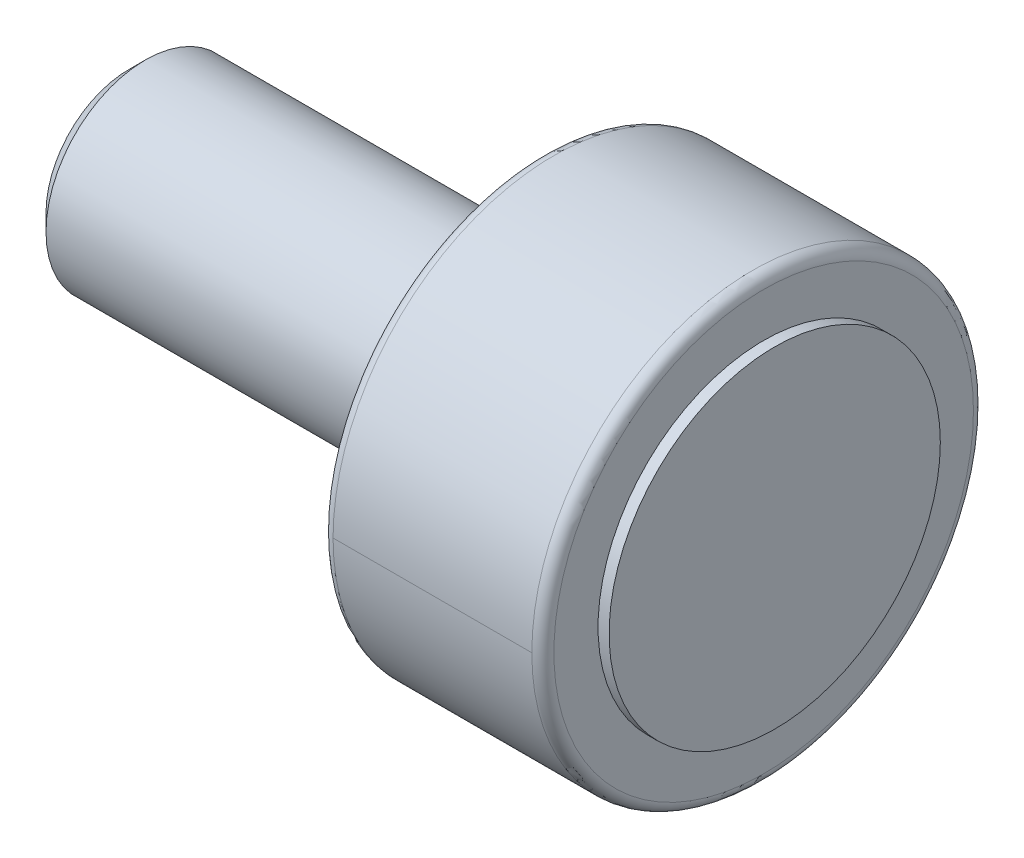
ISO-10303-21;
HEADER;
FILE_DESCRIPTION(('STEP AP214'),'2;1');
FILE_NAME('part.step','',(''),(''),'','','');
FILE_SCHEMA(('AUTOMOTIVE_DESIGN { 1 0 10303 214 1 1 1 1 }'));
ENDSEC;
DATA;
#1=APPLICATION_CONTEXT('core data for automotive mechanical design processes');
#2=APPLICATION_PROTOCOL_DEFINITION('international standard','automotive_design',2000,#1);
#3=PRODUCT_CONTEXT('',#1,'mechanical');
#4=PRODUCT('Part','Part','',(#3));
#5=PRODUCT_RELATED_PRODUCT_CATEGORY('part','',(#4));
#6=PRODUCT_DEFINITION_FORMATION('','',#4);
#7=PRODUCT_DEFINITION_CONTEXT('part definition',#1,'design');
#8=PRODUCT_DEFINITION('design','',#6,#7);
#9=PRODUCT_DEFINITION_SHAPE('','',#8);
#10=(LENGTH_UNIT() NAMED_UNIT(*) SI_UNIT(.MILLI.,.METRE.));
#11=(NAMED_UNIT(*) PLANE_ANGLE_UNIT() SI_UNIT($,.RADIAN.));
#12=(NAMED_UNIT(*) SI_UNIT($,.STERADIAN.) SOLID_ANGLE_UNIT());
#13=UNCERTAINTY_MEASURE_WITH_UNIT(LENGTH_MEASURE(1.E-05),#10,'distance_accuracy_value','');
#14=(GEOMETRIC_REPRESENTATION_CONTEXT(3) GLOBAL_UNCERTAINTY_ASSIGNED_CONTEXT((#13)) GLOBAL_UNIT_ASSIGNED_CONTEXT((#10,
#11,#12)) REPRESENTATION_CONTEXT('',''));
#15=CARTESIAN_POINT('',(0.,0.,0.));
#16=DIRECTION('',(0.,0.,1.));
#17=DIRECTION('',(1.,0.,0.));
#18=AXIS2_PLACEMENT_3D('',#15,#16,#17);
#19=CARTESIAN_POINT('',(0.,0.,0.));
#20=DIRECTION('',(1.,0.,0.));
#21=DIRECTION('',(0.,0.,-1.));
#22=AXIS2_PLACEMENT_3D('',#19,#20,#21);
#23=CYLINDRICAL_SURFACE('',#22,20.);
#24=CARTESIAN_POINT('',(-2.,0.,0.));
#25=DIRECTION('',(1.,0.,0.));
#26=DIRECTION('',(0.,0.,-1.));
#27=AXIS2_PLACEMENT_3D('',#24,#25,#26);
#28=CIRCLE('',#27,20.);
#29=CARTESIAN_POINT('',(-2.,0.,20.));
#30=VERTEX_POINT('',#29);
#31=CARTESIAN_POINT('',(-2.,0.,-20.));
#32=VERTEX_POINT('',#31);
#33=EDGE_CURVE('E61',#30,#32,#28,.F.);
#34=ORIENTED_EDGE('',*,*,#33,.T.);
#35=DIRECTION('',(1.,0.,0.));
#36=VECTOR('',#35,1.);
#37=CARTESIAN_POINT('',(0.,0.,-20.));
#38=LINE('',#37,#36);
#39=CARTESIAN_POINT('',(-20.,0.,-20.));
#40=VERTEX_POINT('',#39);
#41=EDGE_CURVE('E11',#32,#40,#38,.F.);
#42=ORIENTED_EDGE('',*,*,#41,.T.);
#43=CARTESIAN_POINT('',(-20.,0.,0.));
#44=DIRECTION('',(-1.,0.,0.));
#45=DIRECTION('',(0.,0.,1.));
#46=AXIS2_PLACEMENT_3D('',#43,#44,#45);
#47=CIRCLE('',#46,20.);
#48=CARTESIAN_POINT('',(-20.,0.,20.));
#49=VERTEX_POINT('',#48);
#50=EDGE_CURVE('E117',#40,#49,#47,.F.);
#51=ORIENTED_EDGE('',*,*,#50,.T.);
#52=DIRECTION('',(1.,0.,0.));
#53=VECTOR('',#52,1.);
#54=CARTESIAN_POINT('',(0.,0.,20.));
#55=LINE('',#54,#53);
#56=EDGE_CURVE('E34',#49,#30,#55,.T.);
#57=ORIENTED_EDGE('',*,*,#56,.T.);
#58=EDGE_LOOP('',(#34,#42,#51,#57));
#59=FACE_BOUND('',#58,.T.);
#60=ADVANCED_FACE('F30',(#59),#23,.T.);
#61=CARTESIAN_POINT('',(0.,15.,0.));
#62=DIRECTION('',(1.,0.,0.));
#63=DIRECTION('',(0.,0.,-1.));
#64=AXIS2_PLACEMENT_3D('',#61,#62,#63);
#65=PLANE('',#64);
#66=CARTESIAN_POINT('',(0.,0.,0.));
#67=DIRECTION('',(1.,0.,0.));
#68=DIRECTION('',(0.,0.,-1.));
#69=AXIS2_PLACEMENT_3D('',#66,#67,#68);
#70=CIRCLE('',#69,15.);
#71=CARTESIAN_POINT('',(0.,0.,-15.));
#72=VERTEX_POINT('',#71);
#73=EDGE_CURVE('E113',#72,#72,#70,.T.);
#74=ORIENTED_EDGE('',*,*,#73,.T.);
#75=EDGE_LOOP('',(#74));
#76=FACE_BOUND('',#75,.T.);
#77=ADVANCED_FACE('F32',(#76),#65,.T.);
#78=CARTESIAN_POINT('',(0.,0.,0.));
#79=DIRECTION('',(1.,0.,0.));
#80=DIRECTION('',(0.,0.,-1.));
#81=AXIS2_PLACEMENT_3D('',#78,#79,#80);
#82=CYLINDRICAL_SURFACE('',#81,15.);
#83=CARTESIAN_POINT('',(-0.999999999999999,0.,0.));
#84=DIRECTION('',(1.,0.,0.));
#85=DIRECTION('',(0.,0.,-1.));
#86=AXIS2_PLACEMENT_3D('',#83,#84,#85);
#87=CIRCLE('',#86,15.);
#88=CARTESIAN_POINT('',(-0.999999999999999,0.,-15.));
#89=VERTEX_POINT('',#88);
#90=EDGE_CURVE('E110',#89,#89,#87,.T.);
#91=ORIENTED_EDGE('',*,*,#90,.T.);
#92=EDGE_LOOP('',(#91));
#93=FACE_BOUND('',#92,.T.);
#94=ORIENTED_EDGE('',*,*,#73,.F.);
#95=EDGE_LOOP('',(#94));
#96=FACE_BOUND('',#95,.T.);
#97=ADVANCED_FACE('F135',(#93,#96),#82,.T.);
#98=CARTESIAN_POINT('',(-0.999999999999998,20.,0.));
#99=DIRECTION('',(1.,0.,0.));
#100=DIRECTION('',(0.,0.,-1.));
#101=AXIS2_PLACEMENT_3D('',#98,#99,#100);
#102=PLANE('',#101);
#103=CARTESIAN_POINT('',(-0.999999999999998,0.,0.));
#104=DIRECTION('',(1.,0.,0.));
#105=DIRECTION('',(0.,0.,-1.));
#106=AXIS2_PLACEMENT_3D('',#103,#104,#105);
#107=CIRCLE('',#106,19.);
#108=CARTESIAN_POINT('',(-0.999999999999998,0.,-19.));
#109=VERTEX_POINT('',#108);
#110=EDGE_CURVE('E115',#109,#109,#107,.T.);
#111=ORIENTED_EDGE('',*,*,#110,.T.);
#112=EDGE_LOOP('',(#111));
#113=FACE_BOUND('',#112,.T.);
#114=ORIENTED_EDGE('',*,*,#90,.F.);
#115=EDGE_LOOP('',(#114));
#116=FACE_BOUND('',#115,.T.);
#117=ADVANCED_FACE('F141',(#113,#116),#102,.T.);
#118=ORIENTED_EDGE('',*,*,#41,.F.);
#119=EDGE_CURVE('E57',#32,#30,#28,.F.);
#120=ORIENTED_EDGE('',*,*,#119,.T.);
#121=ORIENTED_EDGE('',*,*,#56,.F.);
#122=EDGE_CURVE('E59',#49,#40,#47,.F.);
#123=ORIENTED_EDGE('',*,*,#122,.T.);
#124=EDGE_LOOP('',(#118,#120,#121,#123));
#125=FACE_BOUND('',#124,.T.);
#126=ADVANCED_FACE('F55',(#125),#23,.T.);
#127=CARTESIAN_POINT('',(-21.,15.,0.));
#128=DIRECTION('',(-1.,0.,0.));
#129=DIRECTION('',(0.,0.,1.));
#130=AXIS2_PLACEMENT_3D('',#127,#128,#129);
#131=PLANE('',#130);
#132=CARTESIAN_POINT('',(-21.,0.,0.));
#133=DIRECTION('',(-1.,0.,0.));
#134=DIRECTION('',(0.,0.,1.));
#135=AXIS2_PLACEMENT_3D('',#132,#133,#134);
#136=CIRCLE('',#135,19.);
#137=CARTESIAN_POINT('',(-21.,0.,19.));
#138=VERTEX_POINT('',#137);
#139=EDGE_CURVE('E66',#138,#138,#136,.T.);
#140=ORIENTED_EDGE('',*,*,#139,.T.);
#141=EDGE_LOOP('',(#140));
#142=FACE_BOUND('',#141,.T.);
#143=CARTESIAN_POINT('',(-21.,0.,0.));
#144=DIRECTION('',(1.,0.,0.));
#145=DIRECTION('',(0.,0.,-1.));
#146=AXIS2_PLACEMENT_3D('',#143,#144,#145);
#147=CIRCLE('',#146,15.);
#148=CARTESIAN_POINT('',(-21.,0.,-15.));
#149=VERTEX_POINT('',#148);
#150=EDGE_CURVE('E105',#149,#149,#147,.T.);
#151=ORIENTED_EDGE('',*,*,#150,.T.);
#152=EDGE_LOOP('',(#151));
#153=FACE_BOUND('',#152,.T.);
#154=ADVANCED_FACE('F140',(#142,#153),#131,.T.);
#155=CARTESIAN_POINT('',(0.,0.,0.));
#156=DIRECTION('',(1.,0.,0.));
#157=DIRECTION('',(0.,0.,-1.));
#158=AXIS2_PLACEMENT_3D('',#155,#156,#157);
#159=CYLINDRICAL_SURFACE('',#158,15.);
#160=CARTESIAN_POINT('',(-22.,0.,0.));
#161=DIRECTION('',(1.,0.,0.));
#162=DIRECTION('',(0.,0.,-1.));
#163=AXIS2_PLACEMENT_3D('',#160,#161,#162);
#164=CIRCLE('',#163,15.);
#165=CARTESIAN_POINT('',(-22.,0.,-15.));
#166=VERTEX_POINT('',#165);
#167=EDGE_CURVE('E102',#166,#166,#164,.T.);
#168=ORIENTED_EDGE('',*,*,#167,.T.);
#169=EDGE_LOOP('',(#168));
#170=FACE_BOUND('',#169,.T.);
#171=ORIENTED_EDGE('',*,*,#150,.F.);
#172=EDGE_LOOP('',(#171));
#173=FACE_BOUND('',#172,.T.);
#174=ADVANCED_FACE('F144',(#170,#173),#159,.T.);
#175=CARTESIAN_POINT('',(-22.,8.99999999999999,0.));
#176=DIRECTION('',(-1.,0.,0.));
#177=DIRECTION('',(0.,0.,1.));
#178=AXIS2_PLACEMENT_3D('',#175,#176,#177);
#179=PLANE('',#178);
#180=CARTESIAN_POINT('',(-22.,0.,0.));
#181=DIRECTION('',(1.,0.,0.));
#182=DIRECTION('',(0.,0.,-1.));
#183=AXIS2_PLACEMENT_3D('',#180,#181,#182);
#184=CIRCLE('',#183,8.99999999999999);
#185=CARTESIAN_POINT('',(-22.,0.,-8.99999999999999));
#186=VERTEX_POINT('',#185);
#187=EDGE_CURVE('E100',#186,#186,#184,.T.);
#188=ORIENTED_EDGE('',*,*,#187,.T.);
#189=EDGE_LOOP('',(#188));
#190=FACE_BOUND('',#189,.T.);
#191=ORIENTED_EDGE('',*,*,#167,.F.);
#192=EDGE_LOOP('',(#191));
#193=FACE_BOUND('',#192,.T.);
#194=ADVANCED_FACE('F96',(#190,#193),#179,.T.);
#195=CARTESIAN_POINT('',(0.,0.,0.));
#196=DIRECTION('',(1.,0.,0.));
#197=DIRECTION('',(0.,0.,-1.));
#198=AXIS2_PLACEMENT_3D('',#195,#196,#197);
#199=CYLINDRICAL_SURFACE('',#198,8.99999999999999);
#200=CARTESIAN_POINT('',(-57.,0.,0.));
#201=DIRECTION('',(-1.,0.,0.));
#202=DIRECTION('',(0.,0.,1.));
#203=AXIS2_PLACEMENT_3D('',#200,#201,#202);
#204=CIRCLE('',#203,8.99999999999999);
#205=CARTESIAN_POINT('',(-57.,0.,8.99999999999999));
#206=VERTEX_POINT('',#205);
#207=EDGE_CURVE('E68',#206,#206,#204,.F.);
#208=ORIENTED_EDGE('',*,*,#207,.T.);
#209=EDGE_LOOP('',(#208));
#210=FACE_BOUND('',#209,.T.);
#211=ORIENTED_EDGE('',*,*,#187,.F.);
#212=EDGE_LOOP('',(#211));
#213=FACE_BOUND('',#212,.T.);
#214=ADVANCED_FACE('F93',(#210,#213),#199,.T.);
#215=CARTESIAN_POINT('',(-58.5,0.,0.));
#216=DIRECTION('',(-1.,0.,0.));
#217=DIRECTION('',(0.,0.,1.));
#218=AXIS2_PLACEMENT_3D('',#215,#216,#217);
#219=PLANE('',#218);
#220=CARTESIAN_POINT('',(-58.5,0.,0.));
#221=DIRECTION('',(-1.,0.,0.));
#222=DIRECTION('',(0.,0.,1.));
#223=AXIS2_PLACEMENT_3D('',#220,#221,#222);
#224=CIRCLE('',#223,7.49999999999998);
#225=CARTESIAN_POINT('',(-58.5,0.,7.49999999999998));
#226=VERTEX_POINT('',#225);
#227=EDGE_CURVE('E75',#226,#226,#224,.T.);
#228=ORIENTED_EDGE('',*,*,#227,.T.);
#229=EDGE_LOOP('',(#228));
#230=FACE_BOUND('',#229,.T.);
#231=ADVANCED_FACE('F84',(#230),#219,.T.);
#232=CARTESIAN_POINT('',(-2.,0.,0.));
#233=DIRECTION('',(1.,0.,0.));
#234=DIRECTION('',(0.,0.,-1.));
#235=AXIS2_PLACEMENT_3D('',#232,#233,#234);
#236=TOROIDAL_SURFACE('',#235,19.,1.);
#237=ORIENTED_EDGE('',*,*,#119,.F.);
#238=ORIENTED_EDGE('',*,*,#33,.F.);
#239=EDGE_LOOP('',(#237,#238));
#240=FACE_BOUND('',#239,.T.);
#241=ORIENTED_EDGE('',*,*,#110,.F.);
#242=EDGE_LOOP('',(#241));
#243=FACE_BOUND('',#242,.T.);
#244=ADVANCED_FACE('F64',(#240,#243),#236,.T.);
#245=CARTESIAN_POINT('',(-20.,0.,0.));
#246=DIRECTION('',(-1.,0.,0.));
#247=DIRECTION('',(0.,0.,1.));
#248=AXIS2_PLACEMENT_3D('',#245,#246,#247);
#249=TOROIDAL_SURFACE('',#248,19.,1.);
#250=ORIENTED_EDGE('',*,*,#139,.F.);
#251=EDGE_LOOP('',(#250));
#252=FACE_BOUND('',#251,.T.);
#253=ORIENTED_EDGE('',*,*,#122,.F.);
#254=ORIENTED_EDGE('',*,*,#50,.F.);
#255=EDGE_LOOP('',(#253,#254));
#256=FACE_BOUND('',#255,.T.);
#257=ADVANCED_FACE('F89',(#252,#256),#249,.T.);
#258=CARTESIAN_POINT('',(-57.,0.,0.));
#259=DIRECTION('',(1.,0.,0.));
#260=DIRECTION('',(0.,0.,-1.));
#261=AXIS2_PLACEMENT_3D('',#258,#259,#260);
#262=CONICAL_SURFACE('',#261,8.99999999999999,0.785398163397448);
#263=ORIENTED_EDGE('',*,*,#227,.F.);
#264=EDGE_LOOP('',(#263));
#265=FACE_BOUND('',#264,.T.);
#266=ORIENTED_EDGE('',*,*,#207,.F.);
#267=EDGE_LOOP('',(#266));
#268=FACE_BOUND('',#267,.T.);
#269=ADVANCED_FACE('F86',(#265,#268),#262,.T.);
#270=CLOSED_SHELL('',(#60,#77,#97,#117,#126,#154,#174,#194,#214,#231,#244,#257,#269));
#271=MANIFOLD_SOLID_BREP('B2',#270);
#272=ADVANCED_BREP_SHAPE_REPRESENTATION('',(#18,#271),#14);
#273=SHAPE_DEFINITION_REPRESENTATION(#9,#272);
ENDSEC;
END-ISO-10303-21;
